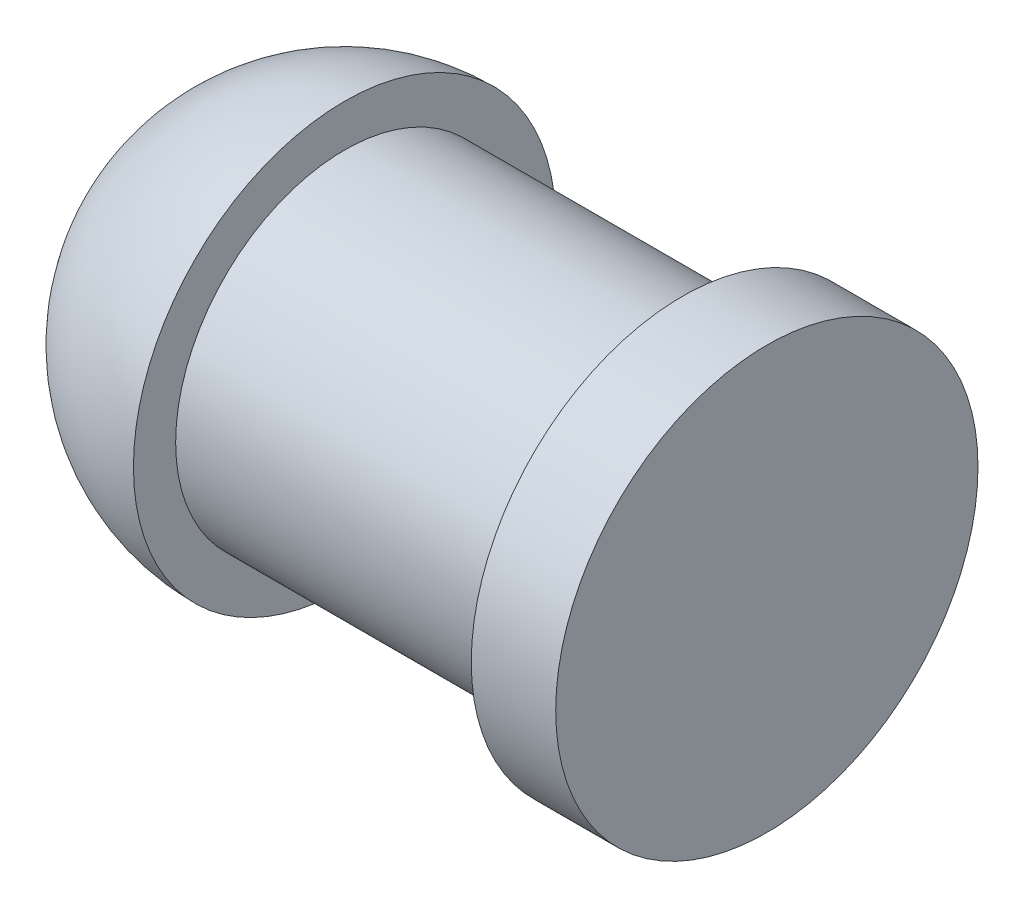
ISO-10303-21;
HEADER;
FILE_DESCRIPTION(('STEP AP214'),'2;1');
FILE_NAME('part.step','',(''),(''),'','','');
FILE_SCHEMA(('AUTOMOTIVE_DESIGN { 1 0 10303 214 1 1 1 1 }'));
ENDSEC;
DATA;
#1=APPLICATION_CONTEXT('core data for automotive mechanical design processes');
#2=APPLICATION_PROTOCOL_DEFINITION('international standard','automotive_design',2000,#1);
#3=PRODUCT_CONTEXT('',#1,'mechanical');
#4=PRODUCT('Part','Part','',(#3));
#5=PRODUCT_RELATED_PRODUCT_CATEGORY('part','',(#4));
#6=PRODUCT_DEFINITION_FORMATION('','',#4);
#7=PRODUCT_DEFINITION_CONTEXT('part definition',#1,'design');
#8=PRODUCT_DEFINITION('design','',#6,#7);
#9=PRODUCT_DEFINITION_SHAPE('','',#8);
#10=(LENGTH_UNIT() NAMED_UNIT(*) SI_UNIT(.MILLI.,.METRE.));
#11=(NAMED_UNIT(*) PLANE_ANGLE_UNIT() SI_UNIT($,.RADIAN.));
#12=(NAMED_UNIT(*) SI_UNIT($,.STERADIAN.) SOLID_ANGLE_UNIT());
#13=UNCERTAINTY_MEASURE_WITH_UNIT(LENGTH_MEASURE(1.E-05),#10,'distance_accuracy_value','');
#14=(GEOMETRIC_REPRESENTATION_CONTEXT(3) GLOBAL_UNCERTAINTY_ASSIGNED_CONTEXT((#13)) GLOBAL_UNIT_ASSIGNED_CONTEXT((#10,
#11,#12)) REPRESENTATION_CONTEXT('',''));
#15=CARTESIAN_POINT('',(0.,0.,0.));
#16=DIRECTION('',(0.,0.,1.));
#17=DIRECTION('',(1.,0.,0.));
#18=AXIS2_PLACEMENT_3D('',#15,#16,#17);
#19=CARTESIAN_POINT('',(0.,0.,0.));
#20=DIRECTION('',(-1.,0.,0.));
#21=DIRECTION('',(0.,0.,1.));
#22=AXIS2_PLACEMENT_3D('',#19,#20,#21);
#23=PLANE('',#22);
#24=CARTESIAN_POINT('',(0.,0.,0.));
#25=DIRECTION('',(-1.,0.,0.));
#26=DIRECTION('',(0.,0.,1.));
#27=AXIS2_PLACEMENT_3D('',#24,#25,#26);
#28=CIRCLE('',#27,5.);
#29=CARTESIAN_POINT('',(0.,0.,5.));
#30=VERTEX_POINT('',#29);
#31=EDGE_CURVE('E10',#30,#30,#28,.T.);
#32=ORIENTED_EDGE('',*,*,#31,.F.);
#33=EDGE_LOOP('',(#32));
#34=FACE_BOUND('',#33,.T.);
#35=ADVANCED_FACE('F30',(#34),#23,.F.);
#36=CARTESIAN_POINT('',(-60.,0.,0.));
#37=DIRECTION('',(-1.,0.,0.));
#38=DIRECTION('',(0.,0.,1.));
#39=AXIS2_PLACEMENT_3D('',#36,#37,#38);
#40=CYLINDRICAL_SURFACE('',#39,5.);
#41=CARTESIAN_POINT('',(-2.,0.,0.));
#42=DIRECTION('',(-1.,0.,0.));
#43=DIRECTION('',(0.,0.,1.));
#44=AXIS2_PLACEMENT_3D('',#41,#42,#43);
#45=CIRCLE('',#44,5.);
#46=CARTESIAN_POINT('',(-2.,0.,5.));
#47=VERTEX_POINT('',#46);
#48=EDGE_CURVE('E36',#47,#47,#45,.T.);
#49=ORIENTED_EDGE('',*,*,#48,.F.);
#50=EDGE_LOOP('',(#49));
#51=FACE_BOUND('',#50,.T.);
#52=ORIENTED_EDGE('',*,*,#31,.T.);
#53=EDGE_LOOP('',(#52));
#54=FACE_BOUND('',#53,.T.);
#55=ADVANCED_FACE('F69',(#51,#54),#40,.T.);
#56=CARTESIAN_POINT('',(-2.,5.,0.));
#57=DIRECTION('',(1.,0.,0.));
#58=DIRECTION('',(0.,0.,-1.));
#59=AXIS2_PLACEMENT_3D('',#56,#57,#58);
#60=PLANE('',#59);
#61=CARTESIAN_POINT('',(-2.,0.,0.));
#62=DIRECTION('',(-1.,0.,0.));
#63=DIRECTION('',(0.,0.,1.));
#64=AXIS2_PLACEMENT_3D('',#61,#62,#63);
#65=CIRCLE('',#64,4.);
#66=CARTESIAN_POINT('',(-2.,0.,4.));
#67=VERTEX_POINT('',#66);
#68=EDGE_CURVE('E40',#67,#67,#65,.T.);
#69=ORIENTED_EDGE('',*,*,#68,.F.);
#70=EDGE_LOOP('',(#69));
#71=FACE_BOUND('',#70,.T.);
#72=ORIENTED_EDGE('',*,*,#48,.T.);
#73=EDGE_LOOP('',(#72));
#74=FACE_BOUND('',#73,.T.);
#75=ADVANCED_FACE('F64',(#71,#74),#60,.F.);
#76=CARTESIAN_POINT('',(-60.,0.,0.));
#77=DIRECTION('',(-1.,0.,0.));
#78=DIRECTION('',(0.,0.,1.));
#79=AXIS2_PLACEMENT_3D('',#76,#77,#78);
#80=CYLINDRICAL_SURFACE('',#79,4.);
#81=CARTESIAN_POINT('',(-10.,0.,0.));
#82=DIRECTION('',(-1.,0.,0.));
#83=DIRECTION('',(0.,0.,1.));
#84=AXIS2_PLACEMENT_3D('',#81,#82,#83);
#85=CIRCLE('',#84,3.99999999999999);
#86=CARTESIAN_POINT('',(-10.,0.,3.99999999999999));
#87=VERTEX_POINT('',#86);
#88=EDGE_CURVE('E44',#87,#87,#85,.T.);
#89=ORIENTED_EDGE('',*,*,#88,.F.);
#90=EDGE_LOOP('',(#89));
#91=FACE_BOUND('',#90,.T.);
#92=ORIENTED_EDGE('',*,*,#68,.T.);
#93=EDGE_LOOP('',(#92));
#94=FACE_BOUND('',#93,.T.);
#95=ADVANCED_FACE('F58',(#91,#94),#80,.T.);
#96=CARTESIAN_POINT('',(-10.,3.99999999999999,0.));
#97=DIRECTION('',(-1.,0.,0.));
#98=DIRECTION('',(0.,0.,1.));
#99=AXIS2_PLACEMENT_3D('',#96,#97,#98);
#100=PLANE('',#99);
#101=CARTESIAN_POINT('',(-10.,0.,0.));
#102=DIRECTION('',(-1.,0.,0.));
#103=DIRECTION('',(0.,0.,1.));
#104=AXIS2_PLACEMENT_3D('',#101,#102,#103);
#105=CIRCLE('',#104,5.);
#106=CARTESIAN_POINT('',(-10.,0.,5.));
#107=VERTEX_POINT('',#106);
#108=EDGE_CURVE('E49',#107,#107,#105,.T.);
#109=ORIENTED_EDGE('',*,*,#108,.F.);
#110=EDGE_LOOP('',(#109));
#111=FACE_BOUND('',#110,.T.);
#112=ORIENTED_EDGE('',*,*,#88,.T.);
#113=EDGE_LOOP('',(#112));
#114=FACE_BOUND('',#113,.T.);
#115=ADVANCED_FACE('F55',(#111,#114),#100,.F.);
#116=CARTESIAN_POINT('',(-10.,0.,0.));
#117=DIRECTION('',(-1.,0.,0.));
#118=DIRECTION('',(0.,1.,0.));
#119=AXIS2_PLACEMENT_3D('',#116,#117,#118);
#120=SPHERICAL_SURFACE('',#119,5.);
#121=ORIENTED_EDGE('',*,*,#108,.T.);
#122=EDGE_LOOP('',(#121));
#123=FACE_BOUND('',#122,.T.);
#124=ADVANCED_FACE('F53',(#123),#120,.T.);
#125=CLOSED_SHELL('',(#35,#55,#75,#95,#115,#124));
#126=MANIFOLD_SOLID_BREP('B2',#125);
#127=ADVANCED_BREP_SHAPE_REPRESENTATION('',(#18,#126),#14);
#128=SHAPE_DEFINITION_REPRESENTATION(#9,#127);
ENDSEC;
END-ISO-10303-21;
